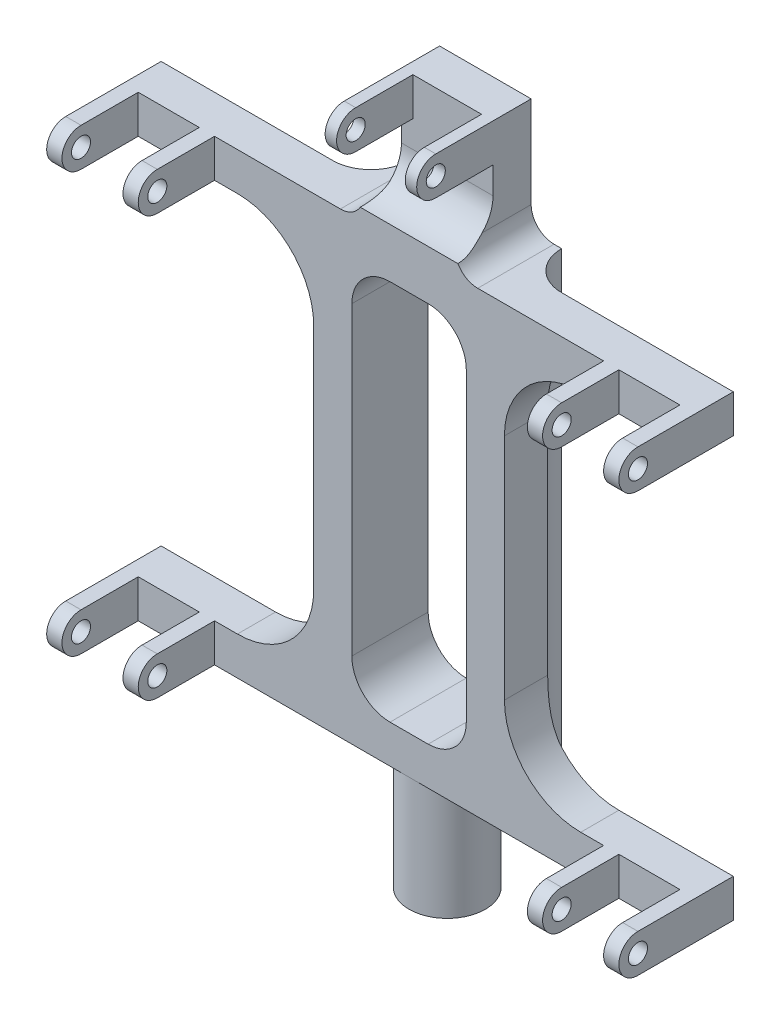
from build123d import *

# Parameters (mm, degrees)
SKETCH1_R               = 10
BOSS_EXTRUDE1_DEPTH     = 120
SKETCH1_3_R             = 10
BOSS_EXTRUDE2_DEPTH     = 30
SKETCH2_R               = 2.5
BOSS_EXTRUDE3_DEPTH     = 4
LPATTERN1_COUNT         = 2
LPATTERN1_PITCH         = 20
MIRROR1_COPY_1_SKETCH_R = 2.5
MIRROR1_COPY_1_DEPTH    = 4
MIRROR2_COPY_1_SKETCH_R = 2.5
MIRROR2_COPY_1_DEPTH    = 4
MIRROR2_COPY_2_SKETCH_R = 2.5
MIRROR2_COPY_2_DEPTH    = 4
MIRROR2_COPY_3_SKETCH_R = 2.5
MIRROR2_COPY_3_DEPTH    = 4
CUT_EXTRUDE2_DEPTH      = 171.367250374
BOSS_EXTRUDE4_START     = 30
BOSS_EXTRUDE4_DEPTH     = 30
CUT_EXTRUDE1_DEPTH      = 169.893457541
CUT_EXTRUDE3_DEPTH      = 30
CUT_EXTRUDE3_DEPTH_BACK = 30
SKETCH8_R               = 2.5
BOSS_EXTRUDE5_DEPTH     = 3


with BuildPart() as part:
    # Sketch1 → Boss-Extrude1 (new body)
    with BuildSketch(Plane(origin=(0, 0, 0), x_dir=(1, 0, 0), z_dir=(0, 1, 0))):
        with BuildLine():
            Line((-75, 10), (-75, -10))
            Line((-75, -10), (-1.7e-08, -10))
            ThreePointArc((-1.7e-08, -10), (-10, -1.4e-08), (-4.5e-08, 10))
            Line((-4.5e-08, 10), (-75, 10))
        make_face()
        with BuildLine():
            ThreePointArc((10, 0), (7.071067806, -7.071067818), (-1.7e-08, -10))
            Line((-1.7e-08, -10), (75, -10))
            Line((75, -10), (75, 10))
            Line((75, 10), (-4.5e-08, 10))
            ThreePointArc((-4.5e-08, 10), (7.071067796, 7.071067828), (10, 0))
        make_face()
        Circle(SKETCH1_R)
    extrude(amount=BOSS_EXTRUDE1_DEPTH)

    # Sketch1_3 → Boss-Extrude2 (add)
    with BuildSketch(Plane(origin=(0, 0, 0), x_dir=(1, 0, 0), z_dir=(0, 1, 0))):
        with Locations(Location((0, 0, 0), (0, 0, 270))):
            Circle(SKETCH1_3_R)
    extrude(amount=-BOSS_EXTRUDE2_DEPTH)

    # Sketch2 → Boss-Extrude3 (add)
    with BuildSketch(Plane.ZY.offset(75)):
        with BuildLine():
            Line((10, 120), (10, 110))
            Line((10, 110), (25, 110))
            ThreePointArc((25, 110), (30, 115), (25, 120))
            Line((25, 120), (10, 120))
        make_face()
        with Locations((25, 115)):
            Circle(SKETCH2_R, mode=Mode.SUBTRACT)
    boss_extrude3 = extrude(amount=-BOSS_EXTRUDE3_DEPTH)

    # LPattern1: Boss-Extrude3 ×2
    with Locations(*[(i * LPATTERN1_PITCH, 0, 0) for i in range(1, LPATTERN1_COUNT)]):
        add(boss_extrude3)

    # Mirror1: Boss-Extrude3 across plane
    add(boss_extrude3.mirror(Plane(origin=(0, 0, 0), x_dir=(0, 0, 1), z_dir=(1, 0, 0))))

    # Mirror1 copy 1 sketch → Mirror1 copy 1 (add)
    with BuildSketch(Plane(origin=(55, 0, 0), x_dir=(0, 0, 1), z_dir=(1, 0, 0))):
        with BuildLine():
            Line((10, -120), (10, -110))
            Line((10, -110), (25, -110))
            ThreePointArc((25, -110), (30, -115), (25, -120))
            Line((25, -120), (10, -120))
        make_face()
        with Locations((25, -115)):
            Circle(MIRROR1_COPY_1_SKETCH_R, mode=Mode.SUBTRACT)
    extrude(amount=-MIRROR1_COPY_1_DEPTH)

    # Mirror2: Boss-Extrude3 across plane
    add(boss_extrude3.mirror(Plane.ZX.offset(60)))

    # Mirror2 copy 1 sketch → Mirror2 copy 1 (add)
    with BuildSketch(Plane(origin=(-55, 120, 0), x_dir=(0, 0, 1), z_dir=(-1, 0, 0))):
        with BuildLine():
            Line((10, -120), (10, -110))
            Line((10, -110), (25, -110))
            ThreePointArc((25, -110), (30, -115), (25, -120))
            Line((25, -120), (10, -120))
        make_face()
        with Locations((25, -115)):
            Circle(MIRROR2_COPY_1_SKETCH_R, mode=Mode.SUBTRACT)
    extrude(amount=-MIRROR2_COPY_1_DEPTH)

    # Mirror2 copy 2 sketch → Mirror2 copy 2 (add)
    with BuildSketch(Plane(origin=(75, 120, 0), x_dir=(0, 0, 1), z_dir=(1, 0, 0))):
        with BuildLine():
            Line((10, 120), (10, 110))
            Line((10, 110), (25, 110))
            ThreePointArc((25, 110), (30, 115), (25, 120))
            Line((25, 120), (10, 120))
        make_face()
        with Locations((25, 115)):
            Circle(MIRROR2_COPY_2_SKETCH_R, mode=Mode.SUBTRACT)
    extrude(amount=-MIRROR2_COPY_2_DEPTH)

    # Mirror2 copy 3 sketch → Mirror2 copy 3 (add)
    with BuildSketch(Plane(origin=(55, 120, 0), x_dir=(0, 0, 1), z_dir=(1, 0, 0))):
        with BuildLine():
            Line((10, 120), (10, 110))
            Line((10, 110), (25, 110))
            ThreePointArc((25, 110), (30, 115), (25, 120))
            Line((25, 120), (10, 120))
        make_face()
        with Locations((25, 115)):
            Circle(MIRROR2_COPY_3_SKETCH_R, mode=Mode.SUBTRACT)
    extrude(amount=-MIRROR2_COPY_3_DEPTH)

    # Sketch5 → Cut-Extrude2 (cut, through all)
    with BuildSketch(Plane(origin=(0, 120, 0), x_dir=(1, 0, 0), z_dir=(0, 1, 0))):
        with BuildLine():
            Line((-75, 0), (-30, 0))
            ThreePointArc((-30, 0), (-22.928932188, 2.928932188), (-20, 10))
            Line((-20, 10), (-75, 10))
            Line((-75, 10), (-75, 0))
        make_face()
        with BuildLine():
            Line((75, 10), (20, 10))
            ThreePointArc((20, 10), (22.928932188, 2.928932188), (30, 0))
            Line((30, 0), (75, 0))
            Line((75, 0), (75, 10))
        make_face()
    extrude(amount=-CUT_EXTRUDE2_DEPTH, mode=Mode.SUBTRACT)

    # Sketch6 → Boss-Extrude4 (add)
    with BuildSketch(Plane(origin=(0, 120, 0), x_dir=(1, 0, 0), z_dir=(0, 1, 0)).offset(BOSS_EXTRUDE4_START)):
        with BuildLine():
            Line((-30, 0), (-30, -10))
            Line((-30, -10), (30, -10))
            Line((30, -10), (30, 0))
            ThreePointArc((30, 0), (22.928932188, 2.928932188), (20, 10))
            Line((20, 10), (-20, 10))
            ThreePointArc((-20, 10), (-22.928932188, 2.928932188), (-30, 0))
        make_face()
    extrude(amount=-BOSS_EXTRUDE4_DEPTH)

    # Sketch3 → Cut-Extrude1 (cut, through all)
    with BuildSketch(Plane.XY.offset(10)):
        with BuildLine():
            Line((-75, 10), (-45, 10))
            ThreePointArc((-45, 10), (-30.857864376, 15.857864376), (-25, 30))
            Line((-25, 30), (-25, 90))
            ThreePointArc((-25, 90), (-30.857864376, 104.142135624), (-45, 110))
            Line((-45, 110), (-75, 110))
            Line((-75, 110), (-75, 10))
        make_face()
        with BuildLine():
            Line((75, 10), (45, 10))
            ThreePointArc((45, 10), (30.857864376, 15.857864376), (25, 30))
            Line((25, 30), (25, 90))
            ThreePointArc((25, 90), (30.857864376, 104.142135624), (45, 110))
            Line((45, 110), (75, 110))
            Line((75, 110), (75, 10))
        make_face()
        with BuildLine():
            Line((-5, 10), (5, 10))
            ThreePointArc((5, 10), (12.071067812, 12.928932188), (15, 20))
            Line((15, 20), (15, 100))
            ThreePointArc((15, 100), (12.071067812, 107.071067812), (5, 110))
            Line((5, 110), (-5, 110))
            ThreePointArc((-5, 110), (-12.071067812, 107.071067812), (-15, 100))
            Line((-15, 100), (-15, 20))
            ThreePointArc((-15, 20), (-12.071067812, 12.928932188), (-5, 10))
        make_face()
        with BuildLine():
            Line((-30, 120), (-18, 120))
            ThreePointArc((-18, 120), (-13.757359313, 121.757359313), (-12, 126))
            Line((-12, 126), (-12, 150))
            Line((-12, 150), (-30, 150))
            Line((-30, 150), (-30, 120))
        make_face()
        with BuildLine():
            Line((30, 150), (30, 120))
            Line((30, 120), (18, 120))
            ThreePointArc((18, 120), (13.757359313, 121.757359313), (12, 126))
            Line((12, 126), (12, 150))
            Line((12, 150), (30, 150))
        make_face()
    extrude(amount=-CUT_EXTRUDE1_DEPTH, mode=Mode.SUBTRACT)

    # Sketch7 → Cut-Extrude3 (cut, two sides: drawn at the far end of the back side and taken through both)
    with BuildSketch(Plane(origin=(0, 0, 0), x_dir=(0, 0, -1), z_dir=(1, 0, 0)).offset(-CUT_EXTRUDE3_DEPTH_BACK)):
        with BuildLine():
            Line((-10, 150), (0, 150))
            Line((0, 150), (0, 133))
            ThreePointArc((0, 133), (-2.928932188, 125.928932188), (-10, 123))
            Line((-10, 123), (-10, 150))
        make_face()
    extrude(amount=CUT_EXTRUDE3_DEPTH + CUT_EXTRUDE3_DEPTH_BACK, mode=Mode.SUBTRACT)

    # Sketch8 → Boss-Extrude5 (add)
    with BuildSketch(Plane.ZY.offset(12)):
        with BuildLine():
            Line((0, 150), (0, 140))
            Line((0, 140), (15, 140))
            ThreePointArc((15, 140), (20, 145), (15, 150))
            Line((15, 150), (0, 150))
        make_face()
        with Locations((15, 145)):
            Circle(SKETCH8_R, mode=Mode.SUBTRACT)
    boss_extrude5 = extrude(amount=-BOSS_EXTRUDE5_DEPTH)

    # Mirror5: Boss-Extrude5 across plane
    add(boss_extrude5.mirror(Plane(origin=(0, 0, 0), x_dir=(0, 0, 1), z_dir=(1, 0, 0))))


solid = part.part
